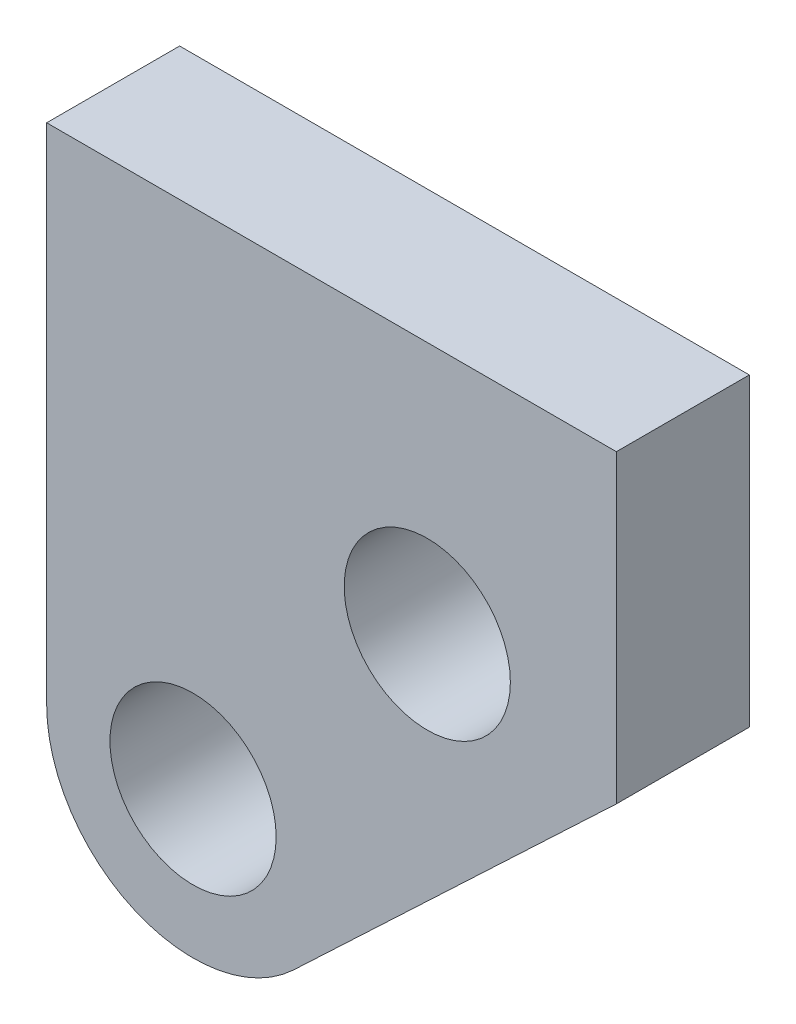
from build123d import *

# Parameters (mm, degrees)
SKETCH1_R          = 6.25
BASE_EXTRUDE_DEPTH = 10


with BuildPart() as part:
    # Sketch1 → Base-Extrude (new body)
    with BuildSketch(Plane.XY):
        with BuildLine():
            Line((29.785193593, -23.187206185), (54.059480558, -0.238916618))
            Line((54.059480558, -0.238916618), (54.059480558, 22.705666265))
            Line((54.059480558, 22.705666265), (11.211177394, 22.705666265))
            Line((11.211177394, 22.705666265), (11.211177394, -15.186351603))
            ThreePointArc((11.211177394, -15.186351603), (17.865606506, -25.298321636), (29.785193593, -23.187206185))
        make_face()
        with Locations((22.221390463, -15.186351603)):
            Circle(SKETCH1_R, mode=Mode.SUBTRACT)
        with Locations((39.837339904, 3.704441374)):
            Circle(SKETCH1_R, mode=Mode.SUBTRACT)
    extrude(amount=-BASE_EXTRUDE_DEPTH)


solid = part.part
